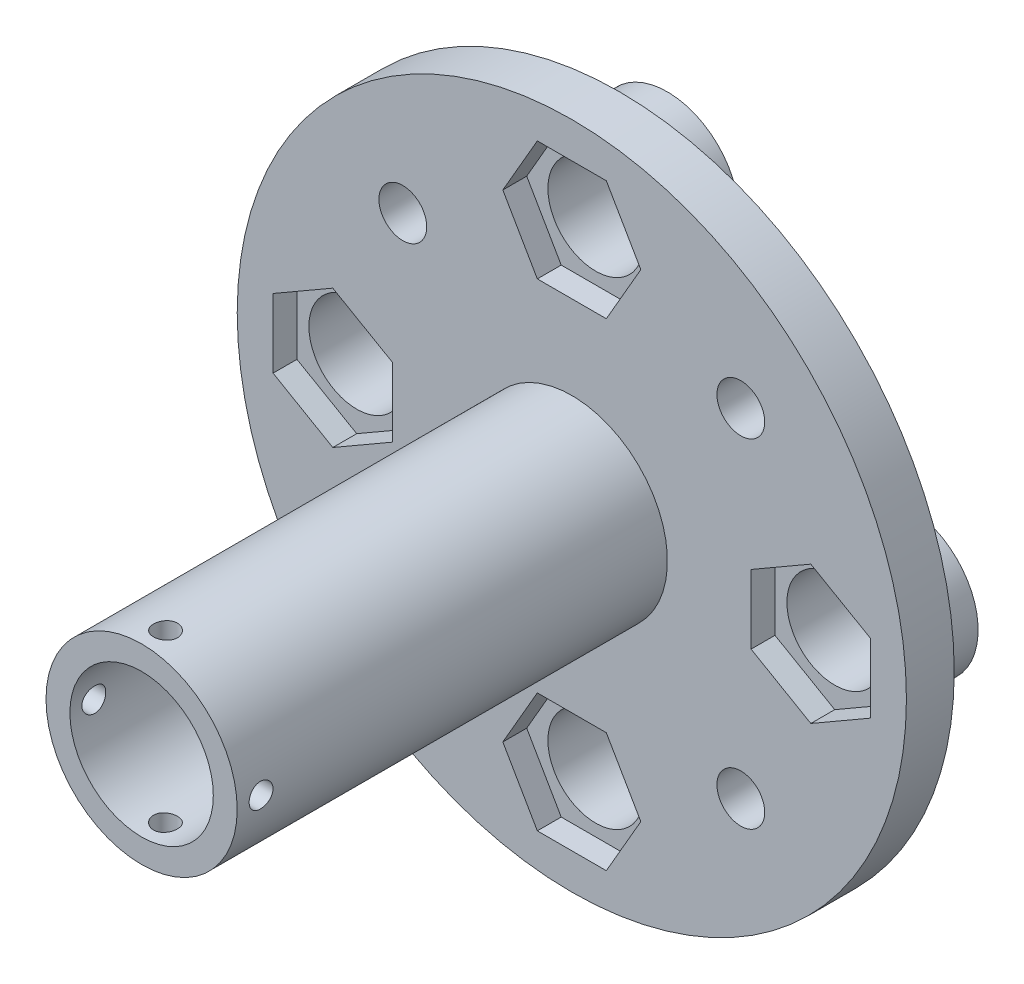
from build123d import *

# Parameters (mm, degrees)
SKETCH1_R               = 20
SKETCH1_R_2             = 15
EXTRUDE1_DEPTH          = 90
EXTRUDE2_START          = 10
SKETCH2_R               = 70
SKETCH2_R_2             = 15
EXTRUDE2_DEPTH          = 10
SKETCH3_R               = 10
CUT_EXTRUDE1_DEPTH      = 141.712472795
CUT_EXTRUDE2_DEPTH      = 5
CUT_EXTRUDE3_DEPTH      = 134.790881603
CUT_EXTRUDE3_DEPTH_BACK = 134.790881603
SKETCH6_R               = 2.5
CUT_EXTRUDE4_DEPTH      = 134.79088167
CUT_EXTRUDE4_DEPTH_BACK = 134.79088167
SKETCH7_R               = 2.5
SKETCH8_R               = 5
CUT_EXTRUDE5_DEPTH      = 134.79088167
EXTRUDE3_START          = 10
SKETCH9_R               = 15
SKETCH9_R_2             = 10
EXTRUDE3_DEPTH          = 10
EXTRUDE5_DEPTH          = 10
EXTRUDE5_DEPTH_BACK     = 10
SKETCH11_R              = 15


with BuildPart() as part:
    # Sketch1 → Extrude1 (new body)
    with BuildSketch(Plane.XY):
        with Locations(Location((0, 0, 0), (0, 0, 180))):
            Circle(SKETCH1_R)
        with Locations(Location((0, 0, 0), (0, 0, 180))):
            Circle(SKETCH1_R_2, mode=Mode.SUBTRACT)
    extrude(amount=EXTRUDE1_DEPTH)

    # Sketch2 → Extrude2 (add)
    with BuildSketch(Plane(origin=(0, 0, 0), x_dir=(-1, 0, 0), z_dir=(0, 0, -1)).offset(EXTRUDE2_START)):
        Circle(SKETCH2_R)
        Circle(SKETCH2_R_2, mode=Mode.SUBTRACT)
    extrude(amount=-EXTRUDE2_DEPTH)

    # Sketch3 → Cut-Extrude1 (cut, through all)
    with BuildSketch(Plane(origin=(0, 0, -10), x_dir=(-1, 0, 0), z_dir=(0, 0, -1))):
        with Locations((0, 50)):
            Circle(SKETCH3_R)
        with Locations((50, 0)):
            Circle(SKETCH3_R)
        with Locations((0, -50)):
            Circle(SKETCH3_R)
        with Locations((-50, 0)):
            Circle(SKETCH3_R)
    extrude(amount=-CUT_EXTRUDE1_DEPTH, mode=Mode.SUBTRACT)

    # Sketch4 → Cut-Extrude2 (cut)
    with BuildSketch(Plane.XY):
        Polygon((50, -14.43375673), (62.5, -7.216878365), (62.5, 7.216878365), (50, 14.43375673), (37.5, 7.216878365), (37.5, -7.216878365), align=None)
        Polygon((14.43375673, 50), (7.216878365, 62.5), (-7.216878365, 62.5), (-14.43375673, 50), (-7.216878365, 37.5), (7.216878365, 37.5), align=None)
        Polygon((-14.43375673, -50), (-7.216878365, -62.5), (7.216878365, -62.5), (14.43375673, -50), (7.216878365, -37.5), (-7.216878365, -37.5), align=None)
        Polygon((-50, 14.43375673), (-62.5, 7.216878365), (-62.5, -7.216878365), (-50, -14.43375673), (-37.5, -7.216878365), (-37.5, 7.216878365), align=None)
    extrude(amount=-CUT_EXTRUDE2_DEPTH, mode=Mode.SUBTRACT)

    # Sketch6 → Cut-Extrude3 (cut, two sides: drawn at the far end of the back side and taken through both)
    with BuildSketch(Plane(origin=(0, 0, 0), x_dir=(0, 0, -1), z_dir=(1, 0, 0)).offset(-CUT_EXTRUDE3_DEPTH_BACK)):
        with Locations((-85, 0)):
            Circle(SKETCH6_R)
    extrude(amount=CUT_EXTRUDE3_DEPTH + CUT_EXTRUDE3_DEPTH_BACK, mode=Mode.SUBTRACT)

    # Sketch7 → Cut-Extrude4 (cut, two sides: drawn at the far end of the back side and taken through both)
    with BuildSketch(Plane(origin=(0, 0, 0), x_dir=(1, 0, 0), z_dir=(0, 1, 0)).offset(-CUT_EXTRUDE4_DEPTH_BACK)):
        with Locations(Location((0, -85, 0), (0, 0, 270))):
            Circle(SKETCH7_R)
    extrude(amount=CUT_EXTRUDE4_DEPTH + CUT_EXTRUDE4_DEPTH_BACK, mode=Mode.SUBTRACT)

    # Sketch8 → Cut-Extrude5 (cut, through all)
    with BuildSketch(Plane.XY):
        with Locations((35.355339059, 35.355339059)):
            Circle(SKETCH8_R)
        with Locations((35.355339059, -35.355339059)):
            Circle(SKETCH8_R)
        with Locations((-35.355339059, -35.355339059)):
            Circle(SKETCH8_R)
        with Locations((-35.355339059, 35.355339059)):
            Circle(SKETCH8_R)
    extrude(amount=-CUT_EXTRUDE5_DEPTH, mode=Mode.SUBTRACT)

    # Sketch9 → Extrude3 (add)
    # profile 1 of 4: a face of its own
    with BuildSketch(Plane(origin=(0, 0, -10), x_dir=(-1, 0, 0), z_dir=(0, 0, -1)).offset(EXTRUDE3_START)):
        with Locations((0, 50)):
            Circle(SKETCH9_R)
        with Locations((0, 50)):
            Circle(SKETCH9_R_2, mode=Mode.SUBTRACT)
    # profile 2 of 4: a face of its own
    with BuildSketch(Plane(origin=(0, 0, -10), x_dir=(-1, 0, 0), z_dir=(0, 0, -1)).offset(EXTRUDE3_START)):
        with Locations((50, 0)):
            Circle(SKETCH9_R)
        with Locations((50, 0)):
            Circle(SKETCH9_R_2, mode=Mode.SUBTRACT)
    # profile 3 of 4: a face of its own
    with BuildSketch(Plane(origin=(0, 0, -10), x_dir=(-1, 0, 0), z_dir=(0, 0, -1)).offset(EXTRUDE3_START)):
        with Locations((0, -50)):
            Circle(SKETCH9_R)
        with Locations((0, -50)):
            Circle(SKETCH9_R_2, mode=Mode.SUBTRACT)
    # profile 4 of 4: a face of its own
    with BuildSketch(Plane(origin=(0, 0, -10), x_dir=(-1, 0, 0), z_dir=(0, 0, -1)).offset(EXTRUDE3_START)):
        with Locations((-50, 0)):
            Circle(SKETCH9_R)
        with Locations((-50, 0)):
            Circle(SKETCH9_R_2, mode=Mode.SUBTRACT)
    extrude(amount=-EXTRUDE3_DEPTH)

    # Sketch11 → Extrude5 (add, two sides: drawn at the far end of the back side and taken through both)
    with BuildSketch(Plane(origin=(0, 0, -10), x_dir=(-1, 0, 0), z_dir=(0, 0, -1)).offset(-EXTRUDE5_DEPTH_BACK)):
        Circle(SKETCH11_R)
        Polygon((11.547005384, 0), (5.773502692, 10), (-5.773502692, 10), (-11.547005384, 0), (-5.773502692, -10), (5.773502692, -10), align=None, mode=Mode.SUBTRACT)
    extrude(amount=EXTRUDE5_DEPTH + EXTRUDE5_DEPTH_BACK)


solid = part.part
